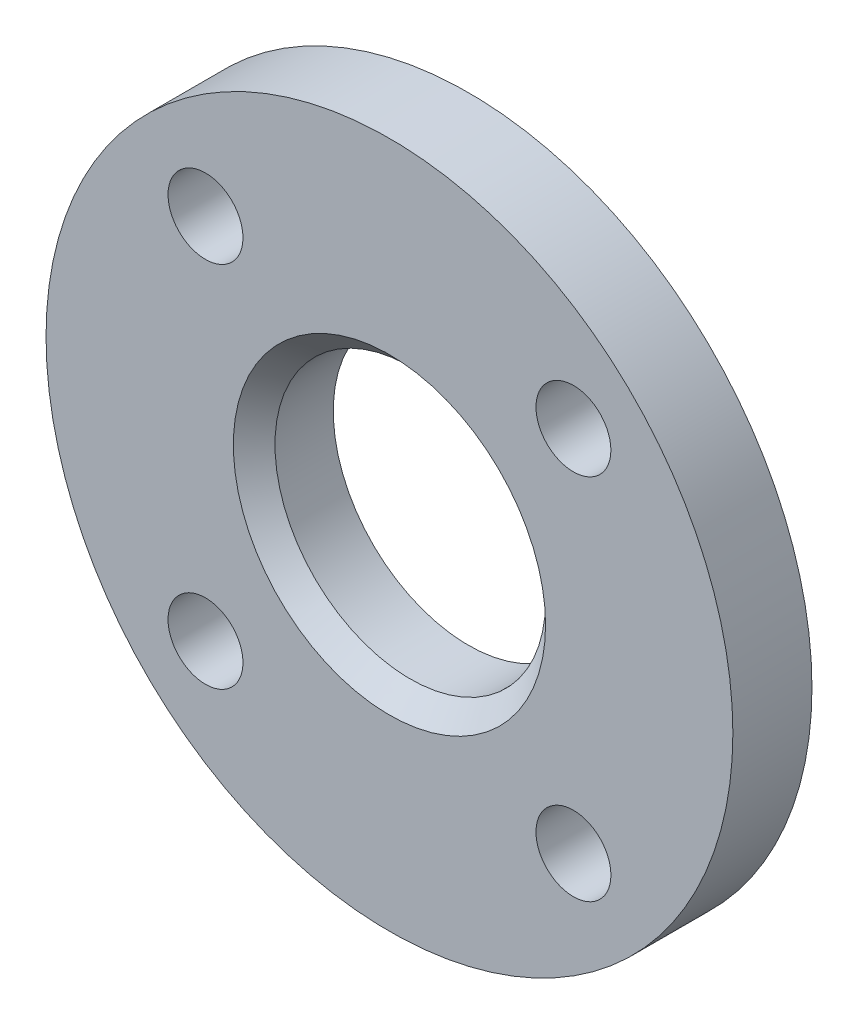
from build123d import *

# Parameters (mm, degrees)
SKETCH1_R          = 82.5
SKETCH1_R_2        = 32.500000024
EXTRUDE1_DEPTH     = 19
CHAMFER1_SIZE      = 5
SKETCH2_R          = 9
CUT_EXTRUDE1_DEPTH = 119.209559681
CIRPATTERN1_COUNT  = 4


with BuildPart() as part:
    # Sketch1 → Extrude1 (new body)
    with BuildSketch(Plane.XY):
        Circle(SKETCH1_R)
        Circle(SKETCH1_R_2, mode=Mode.SUBTRACT)
    extrude(amount=EXTRUDE1_DEPTH)

    # Chamfer1
    chamfer1_edges = [part.edges().sort_by_distance(p)[0] for p in [
        (-32.500000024, 0, 19),
    ]]
    chamfer(chamfer1_edges, length=CHAMFER1_SIZE)

    # Sketch2 → Cut-Extrude1 (cut, through all)
    with BuildSketch(Plane.XY.offset(19)):
        with Locations((44.194173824, 44.194173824)):
            Circle(SKETCH2_R)
    cut_extrude1 = extrude(amount=-CUT_EXTRUDE1_DEPTH, mode=Mode.SUBTRACT)

    # CirPattern1: Cut-Extrude1 ×4 about axis
    cirpattern1_axis = Axis((0, 0, 0), (0, 0, 1))
    for i in range(1, CIRPATTERN1_COUNT):
        add(cut_extrude1.rotate(cirpattern1_axis, i * 360 / CIRPATTERN1_COUNT), mode=Mode.SUBTRACT)


solid = part.part
